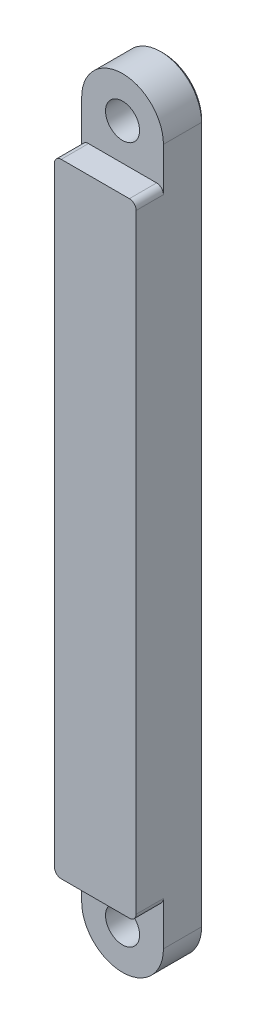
ISO-10303-21;
HEADER;
FILE_DESCRIPTION(('STEP AP214'),'2;1');
FILE_NAME('part.step','',(''),(''),'','','');
FILE_SCHEMA(('AUTOMOTIVE_DESIGN { 1 0 10303 214 1 1 1 1 }'));
ENDSEC;
DATA;
#1=APPLICATION_CONTEXT('core data for automotive mechanical design processes');
#2=APPLICATION_PROTOCOL_DEFINITION('international standard','automotive_design',2000,#1);
#3=PRODUCT_CONTEXT('',#1,'mechanical');
#4=PRODUCT('Part','Part','',(#3));
#5=PRODUCT_RELATED_PRODUCT_CATEGORY('part','',(#4));
#6=PRODUCT_DEFINITION_FORMATION('','',#4);
#7=PRODUCT_DEFINITION_CONTEXT('part definition',#1,'design');
#8=PRODUCT_DEFINITION('design','',#6,#7);
#9=PRODUCT_DEFINITION_SHAPE('','',#8);
#10=(LENGTH_UNIT() NAMED_UNIT(*) SI_UNIT(.MILLI.,.METRE.));
#11=(NAMED_UNIT(*) PLANE_ANGLE_UNIT() SI_UNIT($,.RADIAN.));
#12=(NAMED_UNIT(*) SI_UNIT($,.STERADIAN.) SOLID_ANGLE_UNIT());
#13=UNCERTAINTY_MEASURE_WITH_UNIT(LENGTH_MEASURE(1.E-05),#10,'distance_accuracy_value','');
#14=(GEOMETRIC_REPRESENTATION_CONTEXT(3) GLOBAL_UNCERTAINTY_ASSIGNED_CONTEXT((#13)) GLOBAL_UNIT_ASSIGNED_CONTEXT((#10,
#11,#12)) REPRESENTATION_CONTEXT('',''));
#15=CARTESIAN_POINT('',(0.,0.,0.));
#16=DIRECTION('',(0.,0.,1.));
#17=DIRECTION('',(1.,0.,0.));
#18=AXIS2_PLACEMENT_3D('',#15,#16,#17);
#19=CARTESIAN_POINT('',(-51.5557149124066,47.6770880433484,3.));
#20=DIRECTION('',(0.,0.,1.));
#21=DIRECTION('',(1.,0.,0.));
#22=AXIS2_PLACEMENT_3D('',#19,#20,#21);
#23=PLANE('',#22);
#24=DIRECTION('',(-1.,0.,0.));
#25=VECTOR('',#24,1.);
#26=CARTESIAN_POINT('',(-54.5557149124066,44.9770880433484,3.));
#27=LINE('',#26,#25);
#28=CARTESIAN_POINT('',(-49.0557149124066,44.9770880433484,3.));
#29=VERTEX_POINT('',#28);
#30=CARTESIAN_POINT('',(-54.0557149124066,44.9770880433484,3.));
#31=VERTEX_POINT('',#30);
#32=EDGE_CURVE('E259',#29,#31,#27,.T.);
#33=ORIENTED_EDGE('',*,*,#32,.F.);
#34=CARTESIAN_POINT('',(-49.0557149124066,44.4770880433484,3.));
#35=DIRECTION('',(0.,0.,1.));
#36=DIRECTION('',(1.,0.,0.));
#37=AXIS2_PLACEMENT_3D('',#34,#35,#36);
#38=CIRCLE('',#37,0.5);
#39=CARTESIAN_POINT('',(-48.5557149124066,44.4770880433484,3.));
#40=VERTEX_POINT('',#39);
#41=EDGE_CURVE('E211',#29,#40,#38,.F.);
#42=ORIENTED_EDGE('',*,*,#41,.T.);
#43=DIRECTION('',(0.,1.,0.));
#44=VECTOR('',#43,1.);
#45=CARTESIAN_POINT('',(-48.5557149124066,47.6770880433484,3.));
#46=LINE('',#45,#44);
#47=CARTESIAN_POINT('',(-48.5557149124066,47.6770880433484,3.));
#48=VERTEX_POINT('',#47);
#49=EDGE_CURVE('E167',#40,#48,#46,.T.);
#50=ORIENTED_EDGE('',*,*,#49,.T.);
#51=CARTESIAN_POINT('',(-51.5557149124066,47.6770880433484,3.));
#52=DIRECTION('',(0.,0.,1.));
#53=DIRECTION('',(1.,0.,0.));
#54=AXIS2_PLACEMENT_3D('',#51,#52,#53);
#55=CIRCLE('',#54,3.);
#56=CARTESIAN_POINT('',(-54.5557149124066,47.6770880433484,3.));
#57=VERTEX_POINT('',#56);
#58=EDGE_CURVE('E163',#48,#57,#55,.T.);
#59=ORIENTED_EDGE('',*,*,#58,.T.);
#60=DIRECTION('',(0.,-1.,0.));
#61=VECTOR('',#60,1.);
#62=CARTESIAN_POINT('',(-54.5557149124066,47.6770880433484,3.));
#63=LINE('',#62,#61);
#64=CARTESIAN_POINT('',(-54.5557149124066,44.4770880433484,3.));
#65=VERTEX_POINT('',#64);
#66=EDGE_CURVE('E147',#57,#65,#63,.T.);
#67=ORIENTED_EDGE('',*,*,#66,.T.);
#68=CARTESIAN_POINT('',(-54.0557149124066,44.4770880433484,3.));
#69=DIRECTION('',(0.,0.,1.));
#70=DIRECTION('',(1.,0.,0.));
#71=AXIS2_PLACEMENT_3D('',#68,#69,#70);
#72=CIRCLE('',#71,0.5);
#73=EDGE_CURVE('E213',#65,#31,#72,.F.);
#74=ORIENTED_EDGE('',*,*,#73,.T.);
#75=EDGE_LOOP('',(#33,#42,#50,#59,#67,#74));
#76=FACE_BOUND('',#75,.T.);
#77=CARTESIAN_POINT('',(-51.5557149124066,47.6770880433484,3.));
#78=DIRECTION('',(0.,0.,1.));
#79=DIRECTION('',(1.,0.,0.));
#80=AXIS2_PLACEMENT_3D('',#77,#78,#79);
#81=CIRCLE('',#80,1.25);
#82=CARTESIAN_POINT('',(-50.3057149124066,47.6770880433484,3.));
#83=VERTEX_POINT('',#82);
#84=EDGE_CURVE('E169',#83,#83,#81,.T.);
#85=ORIENTED_EDGE('',*,*,#84,.F.);
#86=EDGE_LOOP('',(#85));
#87=FACE_BOUND('',#86,.T.);
#88=ADVANCED_FACE('F40',(#76,#87),#23,.T.);
#89=DIRECTION('',(1.,0.,0.));
#90=VECTOR('',#89,1.);
#91=CARTESIAN_POINT('',(-54.5557149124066,-0.759700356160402,3.));
#92=LINE('',#91,#90);
#93=CARTESIAN_POINT('',(-54.0557149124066,-0.759700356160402,3.));
#94=VERTEX_POINT('',#93);
#95=CARTESIAN_POINT('',(-49.0557149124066,-0.759700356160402,3.));
#96=VERTEX_POINT('',#95);
#97=EDGE_CURVE('E254',#94,#96,#92,.T.);
#98=ORIENTED_EDGE('',*,*,#97,.F.);
#99=CARTESIAN_POINT('',(-54.0557149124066,-0.259700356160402,3.));
#100=DIRECTION('',(0.,0.,1.));
#101=DIRECTION('',(1.,0.,0.));
#102=AXIS2_PLACEMENT_3D('',#99,#100,#101);
#103=CIRCLE('',#102,0.5);
#104=CARTESIAN_POINT('',(-54.5557149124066,-0.259700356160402,3.));
#105=VERTEX_POINT('',#104);
#106=EDGE_CURVE('E208',#94,#105,#103,.F.);
#107=ORIENTED_EDGE('',*,*,#106,.T.);
#108=CARTESIAN_POINT('',(-54.5557149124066,-3.45970035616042,3.));
#109=VERTEX_POINT('',#108);
#110=EDGE_CURVE('E160',#105,#109,#63,.T.);
#111=ORIENTED_EDGE('',*,*,#110,.T.);
#112=CARTESIAN_POINT('',(-51.5557149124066,-3.45970035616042,3.));
#113=DIRECTION('',(0.,0.,1.));
#114=DIRECTION('',(1.,0.,0.));
#115=AXIS2_PLACEMENT_3D('',#112,#113,#114);
#116=CIRCLE('',#115,3.);
#117=CARTESIAN_POINT('',(-48.5557149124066,-3.45970035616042,3.));
#118=VERTEX_POINT('',#117);
#119=EDGE_CURVE('E159',#109,#118,#116,.T.);
#120=ORIENTED_EDGE('',*,*,#119,.T.);
#121=CARTESIAN_POINT('',(-48.5557149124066,-0.259700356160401,3.));
#122=VERTEX_POINT('',#121);
#123=EDGE_CURVE('E277',#118,#122,#46,.T.);
#124=ORIENTED_EDGE('',*,*,#123,.T.);
#125=CARTESIAN_POINT('',(-49.0557149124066,-0.259700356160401,3.));
#126=DIRECTION('',(0.,0.,1.));
#127=DIRECTION('',(1.,0.,0.));
#128=AXIS2_PLACEMENT_3D('',#125,#126,#127);
#129=CIRCLE('',#128,0.5);
#130=EDGE_CURVE('E206',#122,#96,#129,.F.);
#131=ORIENTED_EDGE('',*,*,#130,.T.);
#132=EDGE_LOOP('',(#98,#107,#111,#120,#124,#131));
#133=FACE_BOUND('',#132,.T.);
#134=CARTESIAN_POINT('',(-51.5557149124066,-3.45970035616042,3.));
#135=DIRECTION('',(0.,0.,1.));
#136=DIRECTION('',(1.,0.,0.));
#137=AXIS2_PLACEMENT_3D('',#134,#135,#136);
#138=CIRCLE('',#137,1.24999999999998);
#139=CARTESIAN_POINT('',(-50.3057149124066,-3.45970035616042,3.));
#140=VERTEX_POINT('',#139);
#141=EDGE_CURVE('E271',#140,#140,#138,.T.);
#142=ORIENTED_EDGE('',*,*,#141,.F.);
#143=EDGE_LOOP('',(#142));
#144=FACE_BOUND('',#143,.T.);
#145=ADVANCED_FACE('F294',(#133,#144),#23,.T.);
#146=CARTESIAN_POINT('',(-51.5557149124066,47.6770880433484,0.));
#147=DIRECTION('',(0.,0.,1.));
#148=DIRECTION('',(1.,0.,0.));
#149=AXIS2_PLACEMENT_3D('',#146,#147,#148);
#150=PLANE('',#149);
#151=CARTESIAN_POINT('',(-51.5557149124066,-3.45970035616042,0.));
#152=DIRECTION('',(0.,0.,1.));
#153=DIRECTION('',(1.,0.,0.));
#154=AXIS2_PLACEMENT_3D('',#151,#152,#153);
#155=CIRCLE('',#154,1.44999999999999);
#156=CARTESIAN_POINT('',(-50.1057149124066,-3.45970035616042,0.));
#157=VERTEX_POINT('',#156);
#158=EDGE_CURVE('E229',#157,#157,#155,.T.);
#159=ORIENTED_EDGE('',*,*,#158,.T.);
#160=EDGE_LOOP('',(#159));
#161=FACE_BOUND('',#160,.T.);
#162=CARTESIAN_POINT('',(-51.5557149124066,47.6770880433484,0.));
#163=DIRECTION('',(0.,0.,1.));
#164=DIRECTION('',(1.,0.,0.));
#165=AXIS2_PLACEMENT_3D('',#162,#163,#164);
#166=CIRCLE('',#165,1.45000000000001);
#167=CARTESIAN_POINT('',(-50.1057149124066,47.6770880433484,0.));
#168=VERTEX_POINT('',#167);
#169=EDGE_CURVE('E226',#168,#168,#166,.T.);
#170=ORIENTED_EDGE('',*,*,#169,.T.);
#171=EDGE_LOOP('',(#170));
#172=FACE_BOUND('',#171,.T.);
#173=CARTESIAN_POINT('',(-51.5557149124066,-3.45970035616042,0.));
#174=DIRECTION('',(0.,0.,1.));
#175=DIRECTION('',(1.,0.,0.));
#176=AXIS2_PLACEMENT_3D('',#173,#174,#175);
#177=CIRCLE('',#176,2.8);
#178=CARTESIAN_POINT('',(-48.7557149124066,-3.45970035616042,0.));
#179=VERTEX_POINT('',#178);
#180=CARTESIAN_POINT('',(-54.3557149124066,-3.45970035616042,0.));
#181=VERTEX_POINT('',#180);
#182=EDGE_CURVE('E219',#179,#181,#177,.F.);
#183=ORIENTED_EDGE('',*,*,#182,.T.);
#184=DIRECTION('',(0.,1.,0.));
#185=VECTOR('',#184,1.);
#186=CARTESIAN_POINT('',(-54.3557149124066,47.6770880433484,0.));
#187=LINE('',#186,#185);
#188=CARTESIAN_POINT('',(-54.3557149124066,47.6770880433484,0.));
#189=VERTEX_POINT('',#188);
#190=EDGE_CURVE('E222',#181,#189,#187,.T.);
#191=ORIENTED_EDGE('',*,*,#190,.T.);
#192=CARTESIAN_POINT('',(-51.5557149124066,47.6770880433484,0.));
#193=DIRECTION('',(0.,0.,1.));
#194=DIRECTION('',(1.,0.,0.));
#195=AXIS2_PLACEMENT_3D('',#192,#193,#194);
#196=CIRCLE('',#195,2.8);
#197=CARTESIAN_POINT('',(-48.7557149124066,47.6770880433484,0.));
#198=VERTEX_POINT('',#197);
#199=EDGE_CURVE('E215',#189,#198,#196,.F.);
#200=ORIENTED_EDGE('',*,*,#199,.T.);
#201=DIRECTION('',(0.,-1.,0.));
#202=VECTOR('',#201,1.);
#203=CARTESIAN_POINT('',(-48.7557149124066,47.6770880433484,0.));
#204=LINE('',#203,#202);
#205=EDGE_CURVE('E217',#198,#179,#204,.T.);
#206=ORIENTED_EDGE('',*,*,#205,.T.);
#207=EDGE_LOOP('',(#183,#191,#200,#206));
#208=FACE_BOUND('',#207,.T.);
#209=ADVANCED_FACE('F345',(#161,#172,#208),#150,.F.);
#210=CARTESIAN_POINT('',(-51.5557149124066,47.6770880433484,3.));
#211=DIRECTION('',(0.,0.,-1.));
#212=DIRECTION('',(-1.,0.,0.));
#213=AXIS2_PLACEMENT_3D('',#210,#211,#212);
#214=CYLINDRICAL_SURFACE('',#213,3.);
#215=DIRECTION('',(0.,0.,-1.));
#216=VECTOR('',#215,1.);
#217=CARTESIAN_POINT('',(-48.5557149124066,47.6770880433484,3.));
#218=LINE('',#217,#216);
#219=CARTESIAN_POINT('',(-48.5557149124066,47.6770880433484,0.199999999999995));
#220=VERTEX_POINT('',#219);
#221=EDGE_CURVE('E279',#48,#220,#218,.T.);
#222=ORIENTED_EDGE('',*,*,#221,.T.);
#223=CARTESIAN_POINT('',(-51.5557149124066,47.6770880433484,0.199999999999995));
#224=DIRECTION('',(0.,0.,1.));
#225=DIRECTION('',(1.,0.,0.));
#226=AXIS2_PLACEMENT_3D('',#223,#224,#225);
#227=CIRCLE('',#226,3.);
#228=CARTESIAN_POINT('',(-54.5557149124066,47.6770880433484,0.199999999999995));
#229=VERTEX_POINT('',#228);
#230=EDGE_CURVE('E11',#220,#229,#227,.T.);
#231=ORIENTED_EDGE('',*,*,#230,.T.);
#232=DIRECTION('',(0.,0.,-1.));
#233=VECTOR('',#232,1.);
#234=CARTESIAN_POINT('',(-54.5557149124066,47.6770880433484,3.));
#235=LINE('',#234,#233);
#236=EDGE_CURVE('E152',#57,#229,#235,.T.);
#237=ORIENTED_EDGE('',*,*,#236,.F.);
#238=ORIENTED_EDGE('',*,*,#58,.F.);
#239=EDGE_LOOP('',(#222,#231,#237,#238));
#240=FACE_BOUND('',#239,.T.);
#241=ADVANCED_FACE('F171',(#240),#214,.T.);
#242=CARTESIAN_POINT('',(-54.5557149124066,47.6770880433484,3.));
#243=DIRECTION('',(1.,0.,0.));
#244=DIRECTION('',(0.,1.,0.));
#245=AXIS2_PLACEMENT_3D('',#242,#243,#244);
#246=PLANE('',#245);
#247=ORIENTED_EDGE('',*,*,#236,.T.);
#248=DIRECTION('',(0.,-1.,0.));
#249=VECTOR('',#248,1.);
#250=CARTESIAN_POINT('',(-54.5557149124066,47.6770880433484,0.199999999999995));
#251=LINE('',#250,#249);
#252=CARTESIAN_POINT('',(-54.5557149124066,-3.45970035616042,0.199999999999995));
#253=VERTEX_POINT('',#252);
#254=EDGE_CURVE('E238',#229,#253,#251,.T.);
#255=ORIENTED_EDGE('',*,*,#254,.T.);
#256=DIRECTION('',(0.,0.,-1.));
#257=VECTOR('',#256,1.);
#258=CARTESIAN_POINT('',(-54.5557149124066,-3.45970035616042,3.));
#259=LINE('',#258,#257);
#260=EDGE_CURVE('E174',#109,#253,#259,.T.);
#261=ORIENTED_EDGE('',*,*,#260,.F.);
#262=ORIENTED_EDGE('',*,*,#110,.F.);
#263=DIRECTION('',(0.,0.,-1.));
#264=VECTOR('',#263,1.);
#265=CARTESIAN_POINT('',(-54.5557149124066,-0.259700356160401,3.));
#266=LINE('',#265,#264);
#267=CARTESIAN_POINT('',(-54.5557149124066,-0.259700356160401,5.));
#268=VERTEX_POINT('',#267);
#269=EDGE_CURVE('E199',#105,#268,#266,.F.);
#270=ORIENTED_EDGE('',*,*,#269,.T.);
#271=DIRECTION('',(0.,-1.,0.));
#272=VECTOR('',#271,1.);
#273=CARTESIAN_POINT('',(-54.5557149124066,44.9770880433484,5.));
#274=LINE('',#273,#272);
#275=CARTESIAN_POINT('',(-54.5557149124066,44.4770880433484,5.));
#276=VERTEX_POINT('',#275);
#277=EDGE_CURVE('E265',#276,#268,#274,.T.);
#278=ORIENTED_EDGE('',*,*,#277,.F.);
#279=DIRECTION('',(0.,0.,-1.));
#280=VECTOR('',#279,1.);
#281=CARTESIAN_POINT('',(-54.5557149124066,44.4770880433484,3.));
#282=LINE('',#281,#280);
#283=EDGE_CURVE('E156',#276,#65,#282,.T.);
#284=ORIENTED_EDGE('',*,*,#283,.T.);
#285=ORIENTED_EDGE('',*,*,#66,.F.);
#286=EDGE_LOOP('',(#247,#255,#261,#262,#270,#278,#284,#285));
#287=FACE_BOUND('',#286,.T.);
#288=ADVANCED_FACE('F149',(#287),#246,.F.);
#289=CARTESIAN_POINT('',(-51.5557149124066,-3.45970035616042,3.));
#290=DIRECTION('',(0.,0.,-1.));
#291=DIRECTION('',(-1.,0.,0.));
#292=AXIS2_PLACEMENT_3D('',#289,#290,#291);
#293=CYLINDRICAL_SURFACE('',#292,3.);
#294=ORIENTED_EDGE('',*,*,#260,.T.);
#295=CARTESIAN_POINT('',(-51.5557149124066,-3.45970035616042,0.199999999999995));
#296=DIRECTION('',(0.,0.,1.));
#297=DIRECTION('',(1.,0.,0.));
#298=AXIS2_PLACEMENT_3D('',#295,#296,#297);
#299=CIRCLE('',#298,3.);
#300=CARTESIAN_POINT('',(-48.5557149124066,-3.45970035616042,0.199999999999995));
#301=VERTEX_POINT('',#300);
#302=EDGE_CURVE('E65',#253,#301,#299,.T.);
#303=ORIENTED_EDGE('',*,*,#302,.T.);
#304=DIRECTION('',(0.,0.,-1.));
#305=VECTOR('',#304,1.);
#306=CARTESIAN_POINT('',(-48.5557149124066,-3.45970035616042,3.));
#307=LINE('',#306,#305);
#308=EDGE_CURVE('E179',#118,#301,#307,.T.);
#309=ORIENTED_EDGE('',*,*,#308,.F.);
#310=ORIENTED_EDGE('',*,*,#119,.F.);
#311=EDGE_LOOP('',(#294,#303,#309,#310));
#312=FACE_BOUND('',#311,.T.);
#313=ADVANCED_FACE('F292',(#312),#293,.T.);
#314=CARTESIAN_POINT('',(-48.5557149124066,47.6770880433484,3.));
#315=DIRECTION('',(-1.,0.,0.));
#316=DIRECTION('',(0.,0.,1.));
#317=AXIS2_PLACEMENT_3D('',#314,#315,#316);
#318=PLANE('',#317);
#319=ORIENTED_EDGE('',*,*,#308,.T.);
#320=DIRECTION('',(0.,1.,0.));
#321=VECTOR('',#320,1.);
#322=CARTESIAN_POINT('',(-48.5557149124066,47.6770880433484,0.199999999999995));
#323=LINE('',#322,#321);
#324=EDGE_CURVE('E50',#301,#220,#323,.T.);
#325=ORIENTED_EDGE('',*,*,#324,.T.);
#326=ORIENTED_EDGE('',*,*,#221,.F.);
#327=ORIENTED_EDGE('',*,*,#49,.F.);
#328=DIRECTION('',(0.,0.,-1.));
#329=VECTOR('',#328,1.);
#330=CARTESIAN_POINT('',(-48.5557149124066,44.4770880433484,3.));
#331=LINE('',#330,#329);
#332=CARTESIAN_POINT('',(-48.5557149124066,44.4770880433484,5.));
#333=VERTEX_POINT('',#332);
#334=EDGE_CURVE('E173',#40,#333,#331,.F.);
#335=ORIENTED_EDGE('',*,*,#334,.T.);
#336=DIRECTION('',(0.,1.,0.));
#337=VECTOR('',#336,1.);
#338=CARTESIAN_POINT('',(-48.5557149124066,-0.759700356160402,5.));
#339=LINE('',#338,#337);
#340=CARTESIAN_POINT('',(-48.5557149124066,-0.259700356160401,5.));
#341=VERTEX_POINT('',#340);
#342=EDGE_CURVE('E318',#341,#333,#339,.T.);
#343=ORIENTED_EDGE('',*,*,#342,.F.);
#344=DIRECTION('',(0.,0.,-1.));
#345=VECTOR('',#344,1.);
#346=CARTESIAN_POINT('',(-48.5557149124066,-0.259700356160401,3.));
#347=LINE('',#346,#345);
#348=EDGE_CURVE('E176',#341,#122,#347,.T.);
#349=ORIENTED_EDGE('',*,*,#348,.T.);
#350=ORIENTED_EDGE('',*,*,#123,.F.);
#351=EDGE_LOOP('',(#319,#325,#326,#327,#335,#343,#349,#350));
#352=FACE_BOUND('',#351,.T.);
#353=ADVANCED_FACE('F281',(#352),#318,.F.);
#354=CARTESIAN_POINT('',(-51.5557149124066,47.6770880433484,3.));
#355=DIRECTION('',(0.,0.,-1.));
#356=DIRECTION('',(-1.,0.,0.));
#357=AXIS2_PLACEMENT_3D('',#354,#355,#356);
#358=CYLINDRICAL_SURFACE('',#357,1.25);
#359=CARTESIAN_POINT('',(-51.5557149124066,47.6770880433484,0.200000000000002));
#360=DIRECTION('',(0.,0.,1.));
#361=DIRECTION('',(1.,0.,0.));
#362=AXIS2_PLACEMENT_3D('',#359,#360,#361);
#363=CIRCLE('',#362,1.25);
#364=CARTESIAN_POINT('',(-50.3057149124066,47.6770880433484,0.200000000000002));
#365=VERTEX_POINT('',#364);
#366=EDGE_CURVE('E235',#365,#365,#363,.F.);
#367=ORIENTED_EDGE('',*,*,#366,.T.);
#368=EDGE_LOOP('',(#367));
#369=FACE_BOUND('',#368,.T.);
#370=ORIENTED_EDGE('',*,*,#84,.T.);
#371=EDGE_LOOP('',(#370));
#372=FACE_BOUND('',#371,.T.);
#373=ADVANCED_FACE('F348',(#369,#372),#358,.F.);
#374=CARTESIAN_POINT('',(-51.5557149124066,-3.45970035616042,3.));
#375=DIRECTION('',(0.,0.,-1.));
#376=DIRECTION('',(-1.,0.,0.));
#377=AXIS2_PLACEMENT_3D('',#374,#375,#376);
#378=CYLINDRICAL_SURFACE('',#377,1.24999999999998);
#379=CARTESIAN_POINT('',(-51.5557149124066,-3.45970035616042,0.199999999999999));
#380=DIRECTION('',(0.,0.,1.));
#381=DIRECTION('',(1.,0.,0.));
#382=AXIS2_PLACEMENT_3D('',#379,#380,#381);
#383=CIRCLE('',#382,1.24999999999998);
#384=CARTESIAN_POINT('',(-50.3057149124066,-3.45970035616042,0.199999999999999));
#385=VERTEX_POINT('',#384);
#386=EDGE_CURVE('E232',#385,#385,#383,.F.);
#387=ORIENTED_EDGE('',*,*,#386,.T.);
#388=EDGE_LOOP('',(#387));
#389=FACE_BOUND('',#388,.T.);
#390=ORIENTED_EDGE('',*,*,#141,.T.);
#391=EDGE_LOOP('',(#390));
#392=FACE_BOUND('',#391,.T.);
#393=ADVANCED_FACE('F372',(#389,#392),#378,.F.);
#394=CARTESIAN_POINT('',(-54.5557149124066,-0.759700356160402,5.));
#395=DIRECTION('',(0.,1.,0.));
#396=DIRECTION('',(0.,0.,1.));
#397=AXIS2_PLACEMENT_3D('',#394,#395,#396);
#398=PLANE('',#397);
#399=ORIENTED_EDGE('',*,*,#97,.T.);
#400=DIRECTION('',(0.,0.,-1.));
#401=VECTOR('',#400,1.);
#402=CARTESIAN_POINT('',(-49.0557149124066,-0.759700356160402,5.));
#403=LINE('',#402,#401);
#404=CARTESIAN_POINT('',(-49.0557149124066,-0.759700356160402,5.));
#405=VERTEX_POINT('',#404);
#406=EDGE_CURVE('E188',#96,#405,#403,.F.);
#407=ORIENTED_EDGE('',*,*,#406,.T.);
#408=DIRECTION('',(1.,0.,0.));
#409=VECTOR('',#408,1.);
#410=CARTESIAN_POINT('',(-54.5557149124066,-0.759700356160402,5.));
#411=LINE('',#410,#409);
#412=CARTESIAN_POINT('',(-54.0557149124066,-0.759700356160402,5.));
#413=VERTEX_POINT('',#412);
#414=EDGE_CURVE('E307',#413,#405,#411,.T.);
#415=ORIENTED_EDGE('',*,*,#414,.F.);
#416=DIRECTION('',(0.,0.,-1.));
#417=VECTOR('',#416,1.);
#418=CARTESIAN_POINT('',(-54.0557149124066,-0.759700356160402,5.));
#419=LINE('',#418,#417);
#420=EDGE_CURVE('E185',#413,#94,#419,.T.);
#421=ORIENTED_EDGE('',*,*,#420,.T.);
#422=EDGE_LOOP('',(#399,#407,#415,#421));
#423=FACE_BOUND('',#422,.T.);
#424=ADVANCED_FACE('F311',(#423),#398,.F.);
#425=CARTESIAN_POINT('',(-54.5557149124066,44.9770880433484,5.));
#426=DIRECTION('',(0.,-1.,0.));
#427=DIRECTION('',(0.,0.,-1.));
#428=AXIS2_PLACEMENT_3D('',#425,#426,#427);
#429=PLANE('',#428);
#430=DIRECTION('',(-1.,0.,0.));
#431=VECTOR('',#430,1.);
#432=CARTESIAN_POINT('',(-54.5557149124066,44.9770880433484,5.));
#433=LINE('',#432,#431);
#434=CARTESIAN_POINT('',(-49.0557149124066,44.9770880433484,5.));
#435=VERTEX_POINT('',#434);
#436=CARTESIAN_POINT('',(-54.0557149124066,44.9770880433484,5.));
#437=VERTEX_POINT('',#436);
#438=EDGE_CURVE('E268',#435,#437,#433,.T.);
#439=ORIENTED_EDGE('',*,*,#438,.F.);
#440=DIRECTION('',(0.,0.,-1.));
#441=VECTOR('',#440,1.);
#442=CARTESIAN_POINT('',(-49.0557149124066,44.9770880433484,5.));
#443=LINE('',#442,#441);
#444=EDGE_CURVE('E203',#435,#29,#443,.T.);
#445=ORIENTED_EDGE('',*,*,#444,.T.);
#446=ORIENTED_EDGE('',*,*,#32,.T.);
#447=DIRECTION('',(0.,0.,-1.));
#448=VECTOR('',#447,1.);
#449=CARTESIAN_POINT('',(-54.0557149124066,44.9770880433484,5.));
#450=LINE('',#449,#448);
#451=EDGE_CURVE('E201',#31,#437,#450,.F.);
#452=ORIENTED_EDGE('',*,*,#451,.T.);
#453=EDGE_LOOP('',(#439,#445,#446,#452));
#454=FACE_BOUND('',#453,.T.);
#455=ADVANCED_FACE('F328',(#454),#429,.F.);
#456=CARTESIAN_POINT('',(0.,0.,5.));
#457=DIRECTION('',(0.,0.,1.));
#458=DIRECTION('',(1.,0.,0.));
#459=AXIS2_PLACEMENT_3D('',#456,#457,#458);
#460=PLANE('',#459);
#461=ORIENTED_EDGE('',*,*,#414,.T.);
#462=CARTESIAN_POINT('',(-49.0557149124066,-0.259700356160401,5.));
#463=DIRECTION('',(0.,0.,1.));
#464=DIRECTION('',(1.,0.,0.));
#465=AXIS2_PLACEMENT_3D('',#462,#463,#464);
#466=CIRCLE('',#465,0.5);
#467=EDGE_CURVE('E196',#405,#341,#466,.T.);
#468=ORIENTED_EDGE('',*,*,#467,.T.);
#469=ORIENTED_EDGE('',*,*,#342,.T.);
#470=CARTESIAN_POINT('',(-49.0557149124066,44.4770880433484,5.));
#471=DIRECTION('',(0.,0.,1.));
#472=DIRECTION('',(1.,0.,0.));
#473=AXIS2_PLACEMENT_3D('',#470,#471,#472);
#474=CIRCLE('',#473,0.5);
#475=EDGE_CURVE('E192',#333,#435,#474,.T.);
#476=ORIENTED_EDGE('',*,*,#475,.T.);
#477=ORIENTED_EDGE('',*,*,#438,.T.);
#478=CARTESIAN_POINT('',(-54.0557149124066,44.4770880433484,5.));
#479=DIRECTION('',(0.,0.,1.));
#480=DIRECTION('',(1.,0.,0.));
#481=AXIS2_PLACEMENT_3D('',#478,#479,#480);
#482=CIRCLE('',#481,0.5);
#483=EDGE_CURVE('E190',#437,#276,#482,.T.);
#484=ORIENTED_EDGE('',*,*,#483,.T.);
#485=ORIENTED_EDGE('',*,*,#277,.T.);
#486=CARTESIAN_POINT('',(-54.0557149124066,-0.259700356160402,5.));
#487=DIRECTION('',(0.,0.,1.));
#488=DIRECTION('',(1.,0.,0.));
#489=AXIS2_PLACEMENT_3D('',#486,#487,#488);
#490=CIRCLE('',#489,0.5);
#491=EDGE_CURVE('E194',#268,#413,#490,.T.);
#492=ORIENTED_EDGE('',*,*,#491,.T.);
#493=EDGE_LOOP('',(#461,#468,#469,#476,#477,#484,#485,#492));
#494=FACE_BOUND('',#493,.T.);
#495=ADVANCED_FACE('F303',(#494),#460,.T.);
#496=CARTESIAN_POINT('',(-49.0557149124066,-0.259700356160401,3.));
#497=DIRECTION('',(0.,0.,-1.));
#498=DIRECTION('',(-1.,0.,0.));
#499=AXIS2_PLACEMENT_3D('',#496,#497,#498);
#500=CYLINDRICAL_SURFACE('',#499,0.5);
#501=ORIENTED_EDGE('',*,*,#467,.F.);
#502=ORIENTED_EDGE('',*,*,#406,.F.);
#503=ORIENTED_EDGE('',*,*,#130,.F.);
#504=ORIENTED_EDGE('',*,*,#348,.F.);
#505=EDGE_LOOP('',(#501,#502,#503,#504));
#506=FACE_BOUND('',#505,.T.);
#507=ADVANCED_FACE('F315',(#506),#500,.T.);
#508=CARTESIAN_POINT('',(-54.0557149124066,-0.259700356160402,5.));
#509=DIRECTION('',(0.,0.,-1.));
#510=DIRECTION('',(-1.,0.,0.));
#511=AXIS2_PLACEMENT_3D('',#508,#509,#510);
#512=CYLINDRICAL_SURFACE('',#511,0.5);
#513=ORIENTED_EDGE('',*,*,#491,.F.);
#514=ORIENTED_EDGE('',*,*,#269,.F.);
#515=ORIENTED_EDGE('',*,*,#106,.F.);
#516=ORIENTED_EDGE('',*,*,#420,.F.);
#517=EDGE_LOOP('',(#513,#514,#515,#516));
#518=FACE_BOUND('',#517,.T.);
#519=ADVANCED_FACE('F310',(#518),#512,.T.);
#520=CARTESIAN_POINT('',(-49.0557149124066,44.4770880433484,5.));
#521=DIRECTION('',(0.,0.,-1.));
#522=DIRECTION('',(-1.,0.,0.));
#523=AXIS2_PLACEMENT_3D('',#520,#521,#522);
#524=CYLINDRICAL_SURFACE('',#523,0.5);
#525=ORIENTED_EDGE('',*,*,#475,.F.);
#526=ORIENTED_EDGE('',*,*,#334,.F.);
#527=ORIENTED_EDGE('',*,*,#41,.F.);
#528=ORIENTED_EDGE('',*,*,#444,.F.);
#529=EDGE_LOOP('',(#525,#526,#527,#528));
#530=FACE_BOUND('',#529,.T.);
#531=ADVANCED_FACE('F330',(#530),#524,.T.);
#532=CARTESIAN_POINT('',(-54.0557149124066,44.4770880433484,3.));
#533=DIRECTION('',(0.,0.,-1.));
#534=DIRECTION('',(-1.,0.,0.));
#535=AXIS2_PLACEMENT_3D('',#532,#533,#534);
#536=CYLINDRICAL_SURFACE('',#535,0.5);
#537=ORIENTED_EDGE('',*,*,#483,.F.);
#538=ORIENTED_EDGE('',*,*,#451,.F.);
#539=ORIENTED_EDGE('',*,*,#73,.F.);
#540=ORIENTED_EDGE('',*,*,#283,.F.);
#541=EDGE_LOOP('',(#537,#538,#539,#540));
#542=FACE_BOUND('',#541,.T.);
#543=ADVANCED_FACE('F327',(#542),#536,.T.);
#544=CARTESIAN_POINT('',(-51.5557149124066,-3.45970035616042,0.));
#545=DIRECTION('',(0.,0.,-1.));
#546=DIRECTION('',(-1.,0.,0.));
#547=AXIS2_PLACEMENT_3D('',#544,#545,#546);
#548=CONICAL_SURFACE('',#547,1.44999999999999,0.785398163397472);
#549=ORIENTED_EDGE('',*,*,#386,.F.);
#550=EDGE_LOOP('',(#549));
#551=FACE_BOUND('',#550,.T.);
#552=ORIENTED_EDGE('',*,*,#158,.F.);
#553=EDGE_LOOP('',(#552));
#554=FACE_BOUND('',#553,.T.);
#555=ADVANCED_FACE('F337',(#551,#554),#548,.F.);
#556=CARTESIAN_POINT('',(-51.5557149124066,47.6770880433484,0.));
#557=DIRECTION('',(0.,0.,-1.));
#558=DIRECTION('',(-1.,0.,0.));
#559=AXIS2_PLACEMENT_3D('',#556,#557,#558);
#560=CONICAL_SURFACE('',#559,1.45000000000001,0.785398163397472);
#561=ORIENTED_EDGE('',*,*,#366,.F.);
#562=EDGE_LOOP('',(#561));
#563=FACE_BOUND('',#562,.T.);
#564=ORIENTED_EDGE('',*,*,#169,.F.);
#565=EDGE_LOOP('',(#564));
#566=FACE_BOUND('',#565,.T.);
#567=ADVANCED_FACE('F385',(#563,#566),#560,.F.);
#568=CARTESIAN_POINT('',(-48.5557149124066,47.6770880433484,0.199999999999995));
#569=DIRECTION('',(-0.707106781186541,0.,0.707106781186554));
#570=DIRECTION('',(0.,1.,0.));
#571=AXIS2_PLACEMENT_3D('',#568,#569,#570);
#572=PLANE('',#571);
#573=DIRECTION('',(0.707106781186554,0.,0.707106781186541));
#574=VECTOR('',#573,1.);
#575=CARTESIAN_POINT('',(-48.7557149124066,-3.45970035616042,0.));
#576=LINE('',#575,#574);
#577=EDGE_CURVE('E248',#179,#301,#576,.T.);
#578=ORIENTED_EDGE('',*,*,#577,.F.);
#579=ORIENTED_EDGE('',*,*,#205,.F.);
#580=DIRECTION('',(-0.707106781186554,0.,-0.707106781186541));
#581=VECTOR('',#580,1.);
#582=CARTESIAN_POINT('',(-48.5557149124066,47.6770880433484,0.199999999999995));
#583=LINE('',#582,#581);
#584=EDGE_CURVE('E45',#220,#198,#583,.T.);
#585=ORIENTED_EDGE('',*,*,#584,.F.);
#586=ORIENTED_EDGE('',*,*,#324,.F.);
#587=EDGE_LOOP('',(#578,#579,#585,#586));
#588=FACE_BOUND('',#587,.T.);
#589=ADVANCED_FACE('F43',(#588),#572,.F.);
#590=CARTESIAN_POINT('',(-51.5557149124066,47.6770880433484,0.199999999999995));
#591=DIRECTION('',(0.,0.,1.));
#592=DIRECTION('',(1.,0.,0.));
#593=AXIS2_PLACEMENT_3D('',#590,#591,#592);
#594=CONICAL_SURFACE('',#593,3.,0.785398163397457);
#595=ORIENTED_EDGE('',*,*,#584,.T.);
#596=ORIENTED_EDGE('',*,*,#199,.F.);
#597=DIRECTION('',(0.707106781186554,0.,-0.707106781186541));
#598=VECTOR('',#597,1.);
#599=CARTESIAN_POINT('',(-54.5557149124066,47.6770880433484,0.199999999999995));
#600=LINE('',#599,#598);
#601=EDGE_CURVE('E247',#229,#189,#600,.T.);
#602=ORIENTED_EDGE('',*,*,#601,.F.);
#603=ORIENTED_EDGE('',*,*,#230,.F.);
#604=EDGE_LOOP('',(#595,#596,#602,#603));
#605=FACE_BOUND('',#604,.T.);
#606=ADVANCED_FACE('F285',(#605),#594,.T.);
#607=CARTESIAN_POINT('',(-51.5557149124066,-3.45970035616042,0.199999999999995));
#608=DIRECTION('',(0.,0.,1.));
#609=DIRECTION('',(1.,0.,0.));
#610=AXIS2_PLACEMENT_3D('',#607,#608,#609);
#611=CONICAL_SURFACE('',#610,3.,0.785398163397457);
#612=ORIENTED_EDGE('',*,*,#577,.T.);
#613=ORIENTED_EDGE('',*,*,#302,.F.);
#614=DIRECTION('',(-0.707106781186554,0.,0.707106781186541));
#615=VECTOR('',#614,1.);
#616=CARTESIAN_POINT('',(-54.3557149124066,-3.45970035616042,0.));
#617=LINE('',#616,#615);
#618=EDGE_CURVE('E244',#181,#253,#617,.T.);
#619=ORIENTED_EDGE('',*,*,#618,.F.);
#620=ORIENTED_EDGE('',*,*,#182,.F.);
#621=EDGE_LOOP('',(#612,#613,#619,#620));
#622=FACE_BOUND('',#621,.T.);
#623=ADVANCED_FACE('F391',(#622),#611,.T.);
#624=CARTESIAN_POINT('',(-54.5557149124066,47.6770880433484,0.199999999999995));
#625=DIRECTION('',(0.707106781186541,0.,0.707106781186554));
#626=DIRECTION('',(0.,-1.,0.));
#627=AXIS2_PLACEMENT_3D('',#624,#625,#626);
#628=PLANE('',#627);
#629=ORIENTED_EDGE('',*,*,#601,.T.);
#630=ORIENTED_EDGE('',*,*,#190,.F.);
#631=ORIENTED_EDGE('',*,*,#618,.T.);
#632=ORIENTED_EDGE('',*,*,#254,.F.);
#633=EDGE_LOOP('',(#629,#630,#631,#632));
#634=FACE_BOUND('',#633,.T.);
#635=ADVANCED_FACE('F289',(#634),#628,.F.);
#636=CLOSED_SHELL('',(#88,#145,#209,#241,#288,#313,#353,#373,#393,#424,#455,#495,#507,#519,#531,
#543,#555,#567,#589,#606,#623,#635));
#637=MANIFOLD_SOLID_BREP('B2',#636);
#638=ADVANCED_BREP_SHAPE_REPRESENTATION('',(#18,#637),#14);
#639=SHAPE_DEFINITION_REPRESENTATION(#9,#638);
ENDSEC;
END-ISO-10303-21;
